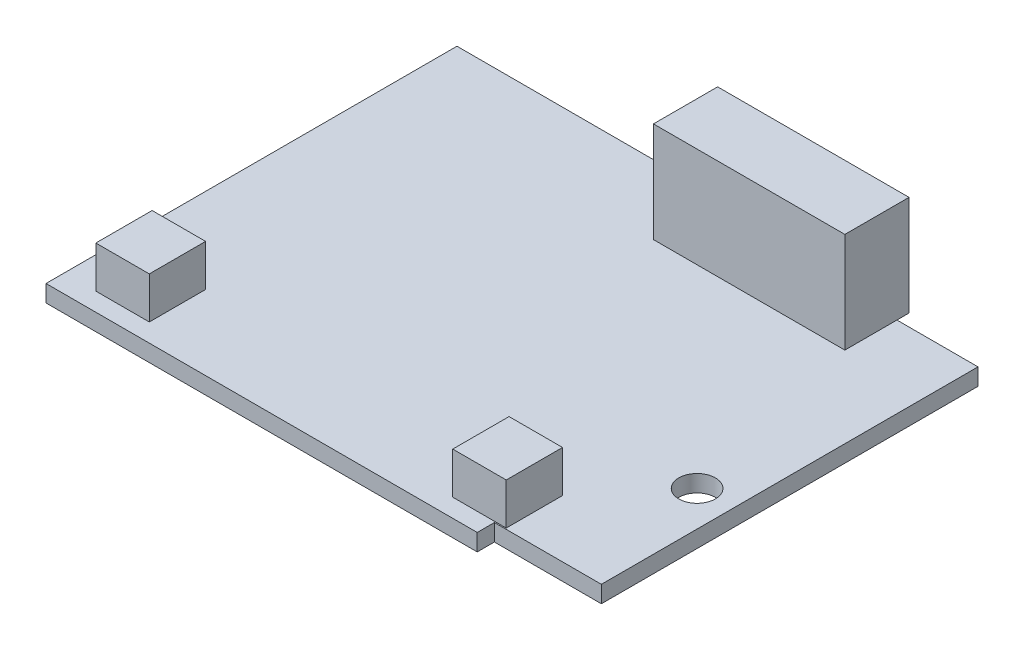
ISO-10303-21;
HEADER;
FILE_DESCRIPTION(('STEP AP214'),'2;1');
FILE_NAME('part.step','',(''),(''),'','','');
FILE_SCHEMA(('AUTOMOTIVE_DESIGN { 1 0 10303 214 1 1 1 1 }'));
ENDSEC;
DATA;
#1=APPLICATION_CONTEXT('core data for automotive mechanical design processes');
#2=APPLICATION_PROTOCOL_DEFINITION('international standard','automotive_design',2000,#1);
#3=PRODUCT_CONTEXT('',#1,'mechanical');
#4=PRODUCT('Part','Part','',(#3));
#5=PRODUCT_RELATED_PRODUCT_CATEGORY('part','',(#4));
#6=PRODUCT_DEFINITION_FORMATION('','',#4);
#7=PRODUCT_DEFINITION_CONTEXT('part definition',#1,'design');
#8=PRODUCT_DEFINITION('design','',#6,#7);
#9=PRODUCT_DEFINITION_SHAPE('','',#8);
#10=(LENGTH_UNIT() NAMED_UNIT(*) SI_UNIT(.MILLI.,.METRE.));
#11=(NAMED_UNIT(*) PLANE_ANGLE_UNIT() SI_UNIT($,.RADIAN.));
#12=(NAMED_UNIT(*) SI_UNIT($,.STERADIAN.) SOLID_ANGLE_UNIT());
#13=UNCERTAINTY_MEASURE_WITH_UNIT(LENGTH_MEASURE(1.E-05),#10,'distance_accuracy_value','');
#14=(GEOMETRIC_REPRESENTATION_CONTEXT(3) GLOBAL_UNCERTAINTY_ASSIGNED_CONTEXT((#13)) GLOBAL_UNIT_ASSIGNED_CONTEXT((#10,
#11,#12)) REPRESENTATION_CONTEXT('',''));
#15=CARTESIAN_POINT('',(0.,0.,0.));
#16=DIRECTION('',(0.,0.,1.));
#17=DIRECTION('',(1.,0.,0.));
#18=AXIS2_PLACEMENT_3D('',#15,#16,#17);
#19=CARTESIAN_POINT('',(-48.5648,0.,18.542));
#20=DIRECTION('',(0.,1.,0.));
#21=DIRECTION('',(0.,0.,1.));
#22=AXIS2_PLACEMENT_3D('',#19,#20,#21);
#23=PLANE('',#22);
#24=DIRECTION('',(0.,0.,-1.));
#25=VECTOR('',#24,1.);
#26=CARTESIAN_POINT('',(-47.1678,0.,6.096));
#27=LINE('',#26,#25);
#28=CARTESIAN_POINT('',(-47.1678,0.,6.096));
#29=VERTEX_POINT('',#28);
#30=CARTESIAN_POINT('',(-47.1678,0.,3.683));
#31=VERTEX_POINT('',#30);
#32=EDGE_CURVE('E256',#29,#31,#27,.T.);
#33=ORIENTED_EDGE('',*,*,#32,.F.);
#34=DIRECTION('',(-1.,0.,0.));
#35=VECTOR('',#34,1.);
#36=CARTESIAN_POINT('',(-47.1678,0.,6.096));
#37=LINE('',#36,#35);
#38=CARTESIAN_POINT('',(-30.4038,0.,6.096));
#39=VERTEX_POINT('',#38);
#40=EDGE_CURVE('E269',#39,#29,#37,.T.);
#41=ORIENTED_EDGE('',*,*,#40,.F.);
#42=DIRECTION('',(0.,0.,1.));
#43=VECTOR('',#42,1.);
#44=CARTESIAN_POINT('',(-30.4038,0.,6.096));
#45=LINE('',#44,#43);
#46=CARTESIAN_POINT('',(-30.4038,0.,3.683));
#47=VERTEX_POINT('',#46);
#48=EDGE_CURVE('E278',#47,#39,#45,.T.);
#49=ORIENTED_EDGE('',*,*,#48,.F.);
#50=DIRECTION('',(1.,0.,0.));
#51=VECTOR('',#50,1.);
#52=CARTESIAN_POINT('',(-30.4038,0.,3.683));
#53=LINE('',#52,#51);
#54=EDGE_CURVE('E259',#31,#47,#53,.T.);
#55=ORIENTED_EDGE('',*,*,#54,.F.);
#56=EDGE_LOOP('',(#33,#41,#49,#55));
#57=FACE_BOUND('',#56,.T.);
#58=DIRECTION('',(0.,0.,1.));
#59=VECTOR('',#58,1.);
#60=CARTESIAN_POINT('',(-48.5648,0.,-18.542));
#61=LINE('',#60,#59);
#62=CARTESIAN_POINT('',(-48.5648,0.,-18.542));
#63=VERTEX_POINT('',#62);
#64=CARTESIAN_POINT('',(-48.5648,0.,18.542));
#65=VERTEX_POINT('',#64);
#66=EDGE_CURVE('E394',#63,#65,#61,.T.);
#67=ORIENTED_EDGE('',*,*,#66,.F.);
#68=DIRECTION('',(-1.,0.,0.));
#69=VECTOR('',#68,1.);
#70=CARTESIAN_POINT('',(-48.5648,0.,-18.542));
#71=LINE('',#70,#69);
#72=CARTESIAN_POINT('',(-9.652,0.,-18.542));
#73=VERTEX_POINT('',#72);
#74=EDGE_CURVE('E401',#73,#63,#71,.T.);
#75=ORIENTED_EDGE('',*,*,#74,.F.);
#76=DIRECTION('',(0.,0.,-1.));
#77=VECTOR('',#76,1.);
#78=CARTESIAN_POINT('',(-9.652,0.,-18.542));
#79=LINE('',#78,#77);
#80=CARTESIAN_POINT('',(-9.652,0.,-16.9926));
#81=VERTEX_POINT('',#80);
#82=EDGE_CURVE('E432',#81,#73,#79,.T.);
#83=ORIENTED_EDGE('',*,*,#82,.F.);
#84=DIRECTION('',(-1.,0.,0.));
#85=VECTOR('',#84,1.);
#86=CARTESIAN_POINT('',(-9.652,0.,-16.9926));
#87=LINE('',#86,#85);
#88=CARTESIAN_POINT('',(0.,0.,-16.9926));
#89=VERTEX_POINT('',#88);
#90=EDGE_CURVE('E430',#89,#81,#87,.T.);
#91=ORIENTED_EDGE('',*,*,#90,.F.);
#92=DIRECTION('',(0.,0.,-1.));
#93=VECTOR('',#92,1.);
#94=CARTESIAN_POINT('',(0.,0.,-16.9926));
#95=LINE('',#94,#93);
#96=CARTESIAN_POINT('',(0.,0.,16.9926));
#97=VERTEX_POINT('',#96);
#98=EDGE_CURVE('E428',#97,#89,#95,.T.);
#99=ORIENTED_EDGE('',*,*,#98,.F.);
#100=DIRECTION('',(1.,0.,0.));
#101=VECTOR('',#100,1.);
#102=CARTESIAN_POINT('',(-9.652,0.,16.9926));
#103=LINE('',#102,#101);
#104=CARTESIAN_POINT('',(-9.652,0.,16.9926));
#105=VERTEX_POINT('',#104);
#106=EDGE_CURVE('E426',#105,#97,#103,.T.);
#107=ORIENTED_EDGE('',*,*,#106,.F.);
#108=DIRECTION('',(0.,0.,-1.));
#109=VECTOR('',#108,1.);
#110=CARTESIAN_POINT('',(-9.652,0.,18.542));
#111=LINE('',#110,#109);
#112=CARTESIAN_POINT('',(-9.652,0.,18.542));
#113=VERTEX_POINT('',#112);
#114=EDGE_CURVE('E424',#113,#105,#111,.T.);
#115=ORIENTED_EDGE('',*,*,#114,.F.);
#116=DIRECTION('',(1.,0.,0.));
#117=VECTOR('',#116,1.);
#118=CARTESIAN_POINT('',(-48.5648,0.,18.542));
#119=LINE('',#118,#117);
#120=EDGE_CURVE('E422',#65,#113,#119,.T.);
#121=ORIENTED_EDGE('',*,*,#120,.F.);
#122=EDGE_LOOP('',(#67,#75,#83,#91,#99,#107,#115,#121));
#123=FACE_BOUND('',#122,.T.);
#124=CARTESIAN_POINT('',(-3.175,0.,5.1816));
#125=DIRECTION('',(0.,1.,0.));
#126=DIRECTION('',(0.,0.,1.));
#127=AXIS2_PLACEMENT_3D('',#124,#125,#126);
#128=CIRCLE('',#127,1.651);
#129=CARTESIAN_POINT('',(-3.175,0.,6.8326));
#130=VERTEX_POINT('',#129);
#131=EDGE_CURVE('E390',#130,#130,#128,.T.);
#132=ORIENTED_EDGE('',*,*,#131,.T.);
#133=EDGE_LOOP('',(#132));
#134=FACE_BOUND('',#133,.T.);
#135=DIRECTION('',(0.,0.,1.));
#136=VECTOR('',#135,1.);
#137=CARTESIAN_POINT('',(-30.4038,0.,-3.8862));
#138=LINE('',#137,#136);
#139=CARTESIAN_POINT('',(-30.4038,0.,-6.2992));
#140=VERTEX_POINT('',#139);
#141=CARTESIAN_POINT('',(-30.4038,0.,-3.8862));
#142=VERTEX_POINT('',#141);
#143=EDGE_CURVE('E255',#140,#142,#138,.T.);
#144=ORIENTED_EDGE('',*,*,#143,.F.);
#145=DIRECTION('',(1.,0.,0.));
#146=VECTOR('',#145,1.);
#147=CARTESIAN_POINT('',(-47.1678,0.,-6.2992));
#148=LINE('',#147,#146);
#149=CARTESIAN_POINT('',(-47.1678,0.,-6.2992));
#150=VERTEX_POINT('',#149);
#151=EDGE_CURVE('E252',#150,#140,#148,.T.);
#152=ORIENTED_EDGE('',*,*,#151,.F.);
#153=DIRECTION('',(0.,0.,-1.));
#154=VECTOR('',#153,1.);
#155=CARTESIAN_POINT('',(-47.1678,0.,-3.8862));
#156=LINE('',#155,#154);
#157=CARTESIAN_POINT('',(-47.1678,0.,-3.8862));
#158=VERTEX_POINT('',#157);
#159=EDGE_CURVE('E64',#158,#150,#156,.T.);
#160=ORIENTED_EDGE('',*,*,#159,.F.);
#161=DIRECTION('',(-1.,0.,0.));
#162=VECTOR('',#161,1.);
#163=CARTESIAN_POINT('',(-30.4038,0.,-3.8862));
#164=LINE('',#163,#162);
#165=EDGE_CURVE('E59',#142,#158,#164,.T.);
#166=ORIENTED_EDGE('',*,*,#165,.F.);
#167=EDGE_LOOP('',(#144,#152,#160,#166));
#168=FACE_BOUND('',#167,.T.);
#169=ADVANCED_FACE('F42',(#57,#123,#134,#168),#23,.F.);
#170=CARTESIAN_POINT('',(-48.5648,1.52399999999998,18.542));
#171=DIRECTION('',(0.,1.,0.));
#172=DIRECTION('',(0.,0.,1.));
#173=AXIS2_PLACEMENT_3D('',#170,#171,#172);
#174=PLANE('',#173);
#175=DIRECTION('',(1.,0.,0.));
#176=VECTOR('',#175,1.);
#177=CARTESIAN_POINT('',(-45.72,1.524,16.891));
#178=LINE('',#177,#176);
#179=CARTESIAN_POINT('',(-45.72,1.524,16.891));
#180=VERTEX_POINT('',#179);
#181=CARTESIAN_POINT('',(-40.894,1.524,16.891));
#182=VERTEX_POINT('',#181);
#183=EDGE_CURVE('E335',#180,#182,#178,.T.);
#184=ORIENTED_EDGE('',*,*,#183,.F.);
#185=DIRECTION('',(0.,0.,1.));
#186=VECTOR('',#185,1.);
#187=CARTESIAN_POINT('',(-45.72,1.524,11.811));
#188=LINE('',#187,#186);
#189=CARTESIAN_POINT('',(-45.72,1.524,11.811));
#190=VERTEX_POINT('',#189);
#191=EDGE_CURVE('E339',#190,#180,#188,.T.);
#192=ORIENTED_EDGE('',*,*,#191,.F.);
#193=DIRECTION('',(-1.,0.,0.));
#194=VECTOR('',#193,1.);
#195=CARTESIAN_POINT('',(-45.72,1.524,11.811));
#196=LINE('',#195,#194);
#197=CARTESIAN_POINT('',(-40.894,1.524,11.811));
#198=VERTEX_POINT('',#197);
#199=EDGE_CURVE('E327',#198,#190,#196,.T.);
#200=ORIENTED_EDGE('',*,*,#199,.F.);
#201=DIRECTION('',(0.,0.,-1.));
#202=VECTOR('',#201,1.);
#203=CARTESIAN_POINT('',(-40.894,1.524,11.811));
#204=LINE('',#203,#202);
#205=EDGE_CURVE('E332',#182,#198,#204,.T.);
#206=ORIENTED_EDGE('',*,*,#205,.F.);
#207=EDGE_LOOP('',(#184,#192,#200,#206));
#208=FACE_BOUND('',#207,.T.);
#209=DIRECTION('',(-1.,0.,0.));
#210=VECTOR('',#209,1.);
#211=CARTESIAN_POINT('',(-24.5872,1.524,-18.0848));
#212=LINE('',#211,#210);
#213=CARTESIAN_POINT('',(-9.65199999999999,1.524,-18.0848));
#214=VERTEX_POINT('',#213);
#215=CARTESIAN_POINT('',(-24.5872,1.524,-18.0848));
#216=VERTEX_POINT('',#215);
#217=EDGE_CURVE('E12',#214,#216,#212,.T.);
#218=ORIENTED_EDGE('',*,*,#217,.F.);
#219=DIRECTION('',(0.,0.,-1.));
#220=VECTOR('',#219,1.);
#221=CARTESIAN_POINT('',(-9.65199999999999,1.524,-18.542));
#222=LINE('',#221,#220);
#223=CARTESIAN_POINT('',(-9.65199999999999,1.524,-18.542));
#224=VERTEX_POINT('',#223);
#225=EDGE_CURVE('E413',#214,#224,#222,.T.);
#226=ORIENTED_EDGE('',*,*,#225,.T.);
#227=DIRECTION('',(-1.,0.,0.));
#228=VECTOR('',#227,1.);
#229=CARTESIAN_POINT('',(-48.5648,1.52399999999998,-18.542));
#230=LINE('',#229,#228);
#231=CARTESIAN_POINT('',(-48.5648,1.52399999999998,-18.542));
#232=VERTEX_POINT('',#231);
#233=EDGE_CURVE('E417',#224,#232,#230,.T.);
#234=ORIENTED_EDGE('',*,*,#233,.T.);
#235=DIRECTION('',(0.,0.,1.));
#236=VECTOR('',#235,1.);
#237=CARTESIAN_POINT('',(-48.5648,1.52399999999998,-18.542));
#238=LINE('',#237,#236);
#239=CARTESIAN_POINT('',(-48.5648,1.52399999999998,18.542));
#240=VERTEX_POINT('',#239);
#241=EDGE_CURVE('E397',#232,#240,#238,.T.);
#242=ORIENTED_EDGE('',*,*,#241,.T.);
#243=DIRECTION('',(1.,0.,0.));
#244=VECTOR('',#243,1.);
#245=CARTESIAN_POINT('',(-48.5648,1.52399999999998,18.542));
#246=LINE('',#245,#244);
#247=CARTESIAN_POINT('',(-9.65199999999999,1.524,18.542));
#248=VERTEX_POINT('',#247);
#249=EDGE_CURVE('E400',#240,#248,#246,.T.);
#250=ORIENTED_EDGE('',*,*,#249,.T.);
#251=DIRECTION('',(0.,0.,-1.));
#252=VECTOR('',#251,1.);
#253=CARTESIAN_POINT('',(-9.65199999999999,1.524,18.542));
#254=LINE('',#253,#252);
#255=CARTESIAN_POINT('',(-9.652,1.524,16.9926));
#256=VERTEX_POINT('',#255);
#257=EDGE_CURVE('E403',#248,#256,#254,.T.);
#258=ORIENTED_EDGE('',*,*,#257,.T.);
#259=DIRECTION('',(1.,0.,0.));
#260=VECTOR('',#259,1.);
#261=CARTESIAN_POINT('',(-9.652,1.524,16.9926));
#262=LINE('',#261,#260);
#263=CARTESIAN_POINT('',(0.,1.52400000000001,16.9926));
#264=VERTEX_POINT('',#263);
#265=EDGE_CURVE('E405',#256,#264,#262,.T.);
#266=ORIENTED_EDGE('',*,*,#265,.T.);
#267=DIRECTION('',(0.,0.,-1.));
#268=VECTOR('',#267,1.);
#269=CARTESIAN_POINT('',(0.,1.52400000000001,-16.9926));
#270=LINE('',#269,#268);
#271=CARTESIAN_POINT('',(0.,1.52400000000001,-16.9926));
#272=VERTEX_POINT('',#271);
#273=EDGE_CURVE('E407',#264,#272,#270,.T.);
#274=ORIENTED_EDGE('',*,*,#273,.T.);
#275=DIRECTION('',(-1.,0.,0.));
#276=VECTOR('',#275,1.);
#277=CARTESIAN_POINT('',(-9.652,1.524,-16.9926));
#278=LINE('',#277,#276);
#279=CARTESIAN_POINT('',(-7.31520000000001,1.524,-16.9926));
#280=VERTEX_POINT('',#279);
#281=EDGE_CURVE('E410',#272,#280,#278,.T.);
#282=ORIENTED_EDGE('',*,*,#281,.T.);
#283=DIRECTION('',(0.,0.,-1.));
#284=VECTOR('',#283,1.);
#285=CARTESIAN_POINT('',(-7.31520000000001,1.524,-18.0848));
#286=LINE('',#285,#284);
#287=CARTESIAN_POINT('',(-7.3152,1.524,-12.2936));
#288=VERTEX_POINT('',#287);
#289=EDGE_CURVE('E375',#288,#280,#286,.T.);
#290=ORIENTED_EDGE('',*,*,#289,.F.);
#291=DIRECTION('',(1.,0.,0.));
#292=VECTOR('',#291,1.);
#293=CARTESIAN_POINT('',(-24.5872,1.524,-12.2936));
#294=LINE('',#293,#292);
#295=CARTESIAN_POINT('',(-24.5872,1.524,-12.2936));
#296=VERTEX_POINT('',#295);
#297=EDGE_CURVE('E371',#296,#288,#294,.T.);
#298=ORIENTED_EDGE('',*,*,#297,.F.);
#299=DIRECTION('',(0.,0.,1.));
#300=VECTOR('',#299,1.);
#301=CARTESIAN_POINT('',(-24.5872,1.524,-18.0848));
#302=LINE('',#301,#300);
#303=EDGE_CURVE('E345',#216,#296,#302,.T.);
#304=ORIENTED_EDGE('',*,*,#303,.F.);
#305=EDGE_LOOP('',(#218,#226,#234,#242,#250,#258,#266,#274,#282,#290,#298,#304));
#306=FACE_BOUND('',#305,.T.);
#307=CARTESIAN_POINT('',(-3.17499999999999,1.524,5.1816));
#308=DIRECTION('',(0.,1.,0.));
#309=DIRECTION('',(0.,0.,1.));
#310=AXIS2_PLACEMENT_3D('',#307,#308,#309);
#311=CIRCLE('',#310,1.651);
#312=CARTESIAN_POINT('',(-3.17499999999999,1.524,6.8326));
#313=VERTEX_POINT('',#312);
#314=EDGE_CURVE('E391',#313,#313,#311,.T.);
#315=ORIENTED_EDGE('',*,*,#314,.F.);
#316=EDGE_LOOP('',(#315));
#317=FACE_BOUND('',#316,.T.);
#318=DIRECTION('',(1.,0.,0.));
#319=VECTOR('',#318,1.);
#320=CARTESIAN_POINT('',(-13.5128,1.524,16.891));
#321=LINE('',#320,#319);
#322=CARTESIAN_POINT('',(-13.5128,1.524,16.891));
#323=VERTEX_POINT('',#322);
#324=CARTESIAN_POINT('',(-8.6868,1.524,16.891));
#325=VERTEX_POINT('',#324);
#326=EDGE_CURVE('E303',#323,#325,#321,.T.);
#327=ORIENTED_EDGE('',*,*,#326,.F.);
#328=DIRECTION('',(0.,0.,1.));
#329=VECTOR('',#328,1.);
#330=CARTESIAN_POINT('',(-13.5128,1.524,11.811));
#331=LINE('',#330,#329);
#332=CARTESIAN_POINT('',(-13.5128,1.524,11.811));
#333=VERTEX_POINT('',#332);
#334=EDGE_CURVE('E307',#333,#323,#331,.T.);
#335=ORIENTED_EDGE('',*,*,#334,.F.);
#336=DIRECTION('',(-1.,0.,0.));
#337=VECTOR('',#336,1.);
#338=CARTESIAN_POINT('',(-13.5128,1.524,11.811));
#339=LINE('',#338,#337);
#340=CARTESIAN_POINT('',(-8.6868,1.524,11.811));
#341=VERTEX_POINT('',#340);
#342=EDGE_CURVE('E295',#341,#333,#339,.T.);
#343=ORIENTED_EDGE('',*,*,#342,.F.);
#344=DIRECTION('',(0.,0.,-1.));
#345=VECTOR('',#344,1.);
#346=CARTESIAN_POINT('',(-8.6868,1.524,11.811));
#347=LINE('',#346,#345);
#348=EDGE_CURVE('E300',#325,#341,#347,.T.);
#349=ORIENTED_EDGE('',*,*,#348,.F.);
#350=EDGE_LOOP('',(#327,#335,#343,#349));
#351=FACE_BOUND('',#350,.T.);
#352=ADVANCED_FACE('F479',(#208,#306,#317,#351),#174,.T.);
#353=CARTESIAN_POINT('',(-48.5648,1.52399999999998,-18.542));
#354=DIRECTION('',(1.,0.,0.));
#355=DIRECTION('',(0.,0.,-1.));
#356=AXIS2_PLACEMENT_3D('',#353,#354,#355);
#357=PLANE('',#356);
#358=ORIENTED_EDGE('',*,*,#66,.T.);
#359=DIRECTION('',(0.,-1.,0.));
#360=VECTOR('',#359,1.);
#361=CARTESIAN_POINT('',(-48.5648,1.52399999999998,18.542));
#362=LINE('',#361,#360);
#363=EDGE_CURVE('E46',#240,#65,#362,.T.);
#364=ORIENTED_EDGE('',*,*,#363,.F.);
#365=ORIENTED_EDGE('',*,*,#241,.F.);
#366=DIRECTION('',(0.,-1.,0.));
#367=VECTOR('',#366,1.);
#368=CARTESIAN_POINT('',(-48.5648,1.52399999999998,-18.542));
#369=LINE('',#368,#367);
#370=EDGE_CURVE('E419',#232,#63,#369,.T.);
#371=ORIENTED_EDGE('',*,*,#370,.T.);
#372=EDGE_LOOP('',(#358,#364,#365,#371));
#373=FACE_BOUND('',#372,.T.);
#374=ADVANCED_FACE('F44',(#373),#357,.F.);
#375=CARTESIAN_POINT('',(-48.5648,1.52399999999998,18.542));
#376=DIRECTION('',(0.,0.,-1.));
#377=DIRECTION('',(-1.,0.,0.));
#378=AXIS2_PLACEMENT_3D('',#375,#376,#377);
#379=PLANE('',#378);
#380=ORIENTED_EDGE('',*,*,#120,.T.);
#381=DIRECTION('',(0.,-1.,0.));
#382=VECTOR('',#381,1.);
#383=CARTESIAN_POINT('',(-9.65199999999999,1.524,18.542));
#384=LINE('',#383,#382);
#385=EDGE_CURVE('E451',#248,#113,#384,.T.);
#386=ORIENTED_EDGE('',*,*,#385,.F.);
#387=ORIENTED_EDGE('',*,*,#249,.F.);
#388=ORIENTED_EDGE('',*,*,#363,.T.);
#389=EDGE_LOOP('',(#380,#386,#387,#388));
#390=FACE_BOUND('',#389,.T.);
#391=ADVANCED_FACE('F460',(#390),#379,.F.);
#392=CARTESIAN_POINT('',(-9.65199999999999,1.524,18.542));
#393=DIRECTION('',(-1.,0.,0.));
#394=DIRECTION('',(0.,0.,1.));
#395=AXIS2_PLACEMENT_3D('',#392,#393,#394);
#396=PLANE('',#395);
#397=ORIENTED_EDGE('',*,*,#114,.T.);
#398=DIRECTION('',(0.,-1.,0.));
#399=VECTOR('',#398,1.);
#400=CARTESIAN_POINT('',(-9.652,1.524,16.9926));
#401=LINE('',#400,#399);
#402=EDGE_CURVE('E449',#256,#105,#401,.T.);
#403=ORIENTED_EDGE('',*,*,#402,.F.);
#404=ORIENTED_EDGE('',*,*,#257,.F.);
#405=ORIENTED_EDGE('',*,*,#385,.T.);
#406=EDGE_LOOP('',(#397,#403,#404,#405));
#407=FACE_BOUND('',#406,.T.);
#408=ADVANCED_FACE('F472',(#407),#396,.F.);
#409=CARTESIAN_POINT('',(-9.652,1.524,16.9926));
#410=DIRECTION('',(0.,0.,-1.));
#411=DIRECTION('',(-1.,0.,0.));
#412=AXIS2_PLACEMENT_3D('',#409,#410,#411);
#413=PLANE('',#412);
#414=ORIENTED_EDGE('',*,*,#106,.T.);
#415=DIRECTION('',(0.,-1.,0.));
#416=VECTOR('',#415,1.);
#417=CARTESIAN_POINT('',(0.,1.52400000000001,16.9926));
#418=LINE('',#417,#416);
#419=EDGE_CURVE('E446',#264,#97,#418,.T.);
#420=ORIENTED_EDGE('',*,*,#419,.F.);
#421=ORIENTED_EDGE('',*,*,#265,.F.);
#422=ORIENTED_EDGE('',*,*,#402,.T.);
#423=EDGE_LOOP('',(#414,#420,#421,#422));
#424=FACE_BOUND('',#423,.T.);
#425=ADVANCED_FACE('F475',(#424),#413,.F.);
#426=CARTESIAN_POINT('',(0.,1.52400000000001,-16.9926));
#427=DIRECTION('',(-1.,0.,0.));
#428=DIRECTION('',(0.,0.,1.));
#429=AXIS2_PLACEMENT_3D('',#426,#427,#428);
#430=PLANE('',#429);
#431=ORIENTED_EDGE('',*,*,#98,.T.);
#432=DIRECTION('',(0.,-1.,0.));
#433=VECTOR('',#432,1.);
#434=CARTESIAN_POINT('',(0.,1.52400000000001,-16.9926));
#435=LINE('',#434,#433);
#436=EDGE_CURVE('E443',#272,#89,#435,.T.);
#437=ORIENTED_EDGE('',*,*,#436,.F.);
#438=ORIENTED_EDGE('',*,*,#273,.F.);
#439=ORIENTED_EDGE('',*,*,#419,.T.);
#440=EDGE_LOOP('',(#431,#437,#438,#439));
#441=FACE_BOUND('',#440,.T.);
#442=ADVANCED_FACE('F495',(#441),#430,.F.);
#443=CARTESIAN_POINT('',(-9.652,1.524,-16.9926));
#444=DIRECTION('',(0.,0.,1.));
#445=DIRECTION('',(1.,0.,0.));
#446=AXIS2_PLACEMENT_3D('',#443,#444,#445);
#447=PLANE('',#446);
#448=ORIENTED_EDGE('',*,*,#90,.T.);
#449=DIRECTION('',(0.,-1.,0.));
#450=VECTOR('',#449,1.);
#451=CARTESIAN_POINT('',(-9.652,1.524,-16.9926));
#452=LINE('',#451,#450);
#453=CARTESIAN_POINT('',(-9.652,1.524,-16.9926));
#454=VERTEX_POINT('',#453);
#455=EDGE_CURVE('E440',#454,#81,#452,.T.);
#456=ORIENTED_EDGE('',*,*,#455,.F.);
#457=EDGE_CURVE('E409',#280,#454,#278,.T.);
#458=ORIENTED_EDGE('',*,*,#457,.F.);
#459=ORIENTED_EDGE('',*,*,#281,.F.);
#460=ORIENTED_EDGE('',*,*,#436,.T.);
#461=EDGE_LOOP('',(#448,#456,#458,#459,#460));
#462=FACE_BOUND('',#461,.T.);
#463=ADVANCED_FACE('F492',(#462),#447,.F.);
#464=CARTESIAN_POINT('',(-9.65199999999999,1.524,-18.542));
#465=DIRECTION('',(-1.,0.,0.));
#466=DIRECTION('',(0.,0.,1.));
#467=AXIS2_PLACEMENT_3D('',#464,#465,#466);
#468=PLANE('',#467);
#469=ORIENTED_EDGE('',*,*,#82,.T.);
#470=DIRECTION('',(0.,-1.,0.));
#471=VECTOR('',#470,1.);
#472=CARTESIAN_POINT('',(-9.65199999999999,1.524,-18.542));
#473=LINE('',#472,#471);
#474=EDGE_CURVE('E437',#224,#73,#473,.T.);
#475=ORIENTED_EDGE('',*,*,#474,.F.);
#476=ORIENTED_EDGE('',*,*,#225,.F.);
#477=EDGE_CURVE('E414',#454,#214,#222,.T.);
#478=ORIENTED_EDGE('',*,*,#477,.F.);
#479=ORIENTED_EDGE('',*,*,#455,.T.);
#480=EDGE_LOOP('',(#469,#475,#476,#478,#479));
#481=FACE_BOUND('',#480,.T.);
#482=ADVANCED_FACE('F488',(#481),#468,.F.);
#483=CARTESIAN_POINT('',(-48.5648,1.52399999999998,-18.542));
#484=DIRECTION('',(0.,0.,1.));
#485=DIRECTION('',(1.,0.,0.));
#486=AXIS2_PLACEMENT_3D('',#483,#484,#485);
#487=PLANE('',#486);
#488=ORIENTED_EDGE('',*,*,#74,.T.);
#489=ORIENTED_EDGE('',*,*,#370,.F.);
#490=ORIENTED_EDGE('',*,*,#233,.F.);
#491=ORIENTED_EDGE('',*,*,#474,.T.);
#492=EDGE_LOOP('',(#488,#489,#490,#491));
#493=FACE_BOUND('',#492,.T.);
#494=ADVANCED_FACE('F486',(#493),#487,.F.);
#495=CARTESIAN_POINT('',(-3.17499999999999,1.524,5.1816));
#496=DIRECTION('',(0.,-1.,0.));
#497=DIRECTION('',(0.,0.,-1.));
#498=AXIS2_PLACEMENT_3D('',#495,#496,#497);
#499=CYLINDRICAL_SURFACE('',#498,1.651);
#500=ORIENTED_EDGE('',*,*,#314,.T.);
#501=EDGE_LOOP('',(#500));
#502=FACE_BOUND('',#501,.T.);
#503=ORIENTED_EDGE('',*,*,#131,.F.);
#504=EDGE_LOOP('',(#503));
#505=FACE_BOUND('',#504,.T.);
#506=ADVANCED_FACE('F516',(#502,#505),#499,.F.);
#507=CARTESIAN_POINT('',(-24.5872,1.524,-12.2936));
#508=DIRECTION('',(0.,1.,0.));
#509=DIRECTION('',(0.,0.,1.));
#510=AXIS2_PLACEMENT_3D('',#507,#508,#509);
#511=PLANE('',#510);
#512=CARTESIAN_POINT('',(-7.31520000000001,1.524,-18.0848));
#513=VERTEX_POINT('',#512);
#514=EDGE_CURVE('E374',#280,#513,#286,.T.);
#515=ORIENTED_EDGE('',*,*,#514,.F.);
#516=ORIENTED_EDGE('',*,*,#457,.T.);
#517=ORIENTED_EDGE('',*,*,#477,.T.);
#518=EDGE_CURVE('E52',#513,#214,#212,.T.);
#519=ORIENTED_EDGE('',*,*,#518,.F.);
#520=EDGE_LOOP('',(#515,#516,#517,#519));
#521=FACE_BOUND('',#520,.T.);
#522=ADVANCED_FACE('F532',(#521),#511,.F.);
#523=CARTESIAN_POINT('',(-24.5872,10.5664,-18.0848));
#524=DIRECTION('',(1.,0.,0.));
#525=DIRECTION('',(0.,0.,-1.));
#526=AXIS2_PLACEMENT_3D('',#523,#524,#525);
#527=PLANE('',#526);
#528=ORIENTED_EDGE('',*,*,#303,.T.);
#529=DIRECTION('',(0.,-1.,0.));
#530=VECTOR('',#529,1.);
#531=CARTESIAN_POINT('',(-24.5872,10.5664,-12.2936));
#532=LINE('',#531,#530);
#533=CARTESIAN_POINT('',(-24.5872,10.5664,-12.2936));
#534=VERTEX_POINT('',#533);
#535=EDGE_CURVE('E387',#534,#296,#532,.T.);
#536=ORIENTED_EDGE('',*,*,#535,.F.);
#537=DIRECTION('',(0.,0.,1.));
#538=VECTOR('',#537,1.);
#539=CARTESIAN_POINT('',(-24.5872,10.5664,-18.0848));
#540=LINE('',#539,#538);
#541=CARTESIAN_POINT('',(-24.5872,10.5664,-18.0848));
#542=VERTEX_POINT('',#541);
#543=EDGE_CURVE('E359',#542,#534,#540,.T.);
#544=ORIENTED_EDGE('',*,*,#543,.F.);
#545=DIRECTION('',(0.,-1.,0.));
#546=VECTOR('',#545,1.);
#547=CARTESIAN_POINT('',(-24.5872,10.5664,-18.0848));
#548=LINE('',#547,#546);
#549=EDGE_CURVE('E368',#542,#216,#548,.T.);
#550=ORIENTED_EDGE('',*,*,#549,.T.);
#551=EDGE_LOOP('',(#528,#536,#544,#550));
#552=FACE_BOUND('',#551,.T.);
#553=ADVANCED_FACE('F539',(#552),#527,.F.);
#554=CARTESIAN_POINT('',(-24.5872,10.5664,-12.2936));
#555=DIRECTION('',(0.,0.,-1.));
#556=DIRECTION('',(-1.,0.,0.));
#557=AXIS2_PLACEMENT_3D('',#554,#555,#556);
#558=PLANE('',#557);
#559=ORIENTED_EDGE('',*,*,#297,.T.);
#560=DIRECTION('',(0.,-1.,0.));
#561=VECTOR('',#560,1.);
#562=CARTESIAN_POINT('',(-7.31519999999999,10.5664,-12.2936));
#563=LINE('',#562,#561);
#564=CARTESIAN_POINT('',(-7.31519999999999,10.5664,-12.2936));
#565=VERTEX_POINT('',#564);
#566=EDGE_CURVE('E384',#565,#288,#563,.T.);
#567=ORIENTED_EDGE('',*,*,#566,.F.);
#568=DIRECTION('',(1.,0.,0.));
#569=VECTOR('',#568,1.);
#570=CARTESIAN_POINT('',(-24.5872,10.5664,-12.2936));
#571=LINE('',#570,#569);
#572=EDGE_CURVE('E362',#534,#565,#571,.T.);
#573=ORIENTED_EDGE('',*,*,#572,.F.);
#574=ORIENTED_EDGE('',*,*,#535,.T.);
#575=EDGE_LOOP('',(#559,#567,#573,#574));
#576=FACE_BOUND('',#575,.T.);
#577=ADVANCED_FACE('F547',(#576),#558,.F.);
#578=CARTESIAN_POINT('',(-7.31519999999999,10.5664,-18.0848));
#579=DIRECTION('',(-1.,0.,0.));
#580=DIRECTION('',(0.,0.,1.));
#581=AXIS2_PLACEMENT_3D('',#578,#579,#580);
#582=PLANE('',#581);
#583=ORIENTED_EDGE('',*,*,#289,.T.);
#584=ORIENTED_EDGE('',*,*,#514,.T.);
#585=DIRECTION('',(0.,-1.,0.));
#586=VECTOR('',#585,1.);
#587=CARTESIAN_POINT('',(-7.31519999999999,10.5664,-18.0848));
#588=LINE('',#587,#586);
#589=CARTESIAN_POINT('',(-7.31519999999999,10.5664,-18.0848));
#590=VERTEX_POINT('',#589);
#591=EDGE_CURVE('E381',#590,#513,#588,.T.);
#592=ORIENTED_EDGE('',*,*,#591,.F.);
#593=DIRECTION('',(0.,0.,-1.));
#594=VECTOR('',#593,1.);
#595=CARTESIAN_POINT('',(-7.31519999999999,10.5664,-18.0848));
#596=LINE('',#595,#594);
#597=EDGE_CURVE('E364',#565,#590,#596,.T.);
#598=ORIENTED_EDGE('',*,*,#597,.F.);
#599=ORIENTED_EDGE('',*,*,#566,.T.);
#600=EDGE_LOOP('',(#583,#584,#592,#598,#599));
#601=FACE_BOUND('',#600,.T.);
#602=ADVANCED_FACE('F555',(#601),#582,.F.);
#603=CARTESIAN_POINT('',(-24.5872,10.5664,-18.0848));
#604=DIRECTION('',(0.,0.,1.));
#605=DIRECTION('',(1.,0.,0.));
#606=AXIS2_PLACEMENT_3D('',#603,#604,#605);
#607=PLANE('',#606);
#608=ORIENTED_EDGE('',*,*,#518,.T.);
#609=ORIENTED_EDGE('',*,*,#217,.T.);
#610=ORIENTED_EDGE('',*,*,#549,.F.);
#611=DIRECTION('',(-1.,0.,0.));
#612=VECTOR('',#611,1.);
#613=CARTESIAN_POINT('',(-24.5872,10.5664,-18.0848));
#614=LINE('',#613,#612);
#615=EDGE_CURVE('E366',#590,#542,#614,.T.);
#616=ORIENTED_EDGE('',*,*,#615,.F.);
#617=ORIENTED_EDGE('',*,*,#591,.T.);
#618=EDGE_LOOP('',(#608,#609,#610,#616,#617));
#619=FACE_BOUND('',#618,.T.);
#620=ADVANCED_FACE('F563',(#619),#607,.F.);
#621=CARTESIAN_POINT('',(-24.5872,10.5664,-12.2936));
#622=DIRECTION('',(0.,1.,0.));
#623=DIRECTION('',(0.,0.,1.));
#624=AXIS2_PLACEMENT_3D('',#621,#622,#623);
#625=PLANE('',#624);
#626=ORIENTED_EDGE('',*,*,#543,.T.);
#627=ORIENTED_EDGE('',*,*,#572,.T.);
#628=ORIENTED_EDGE('',*,*,#597,.T.);
#629=ORIENTED_EDGE('',*,*,#615,.T.);
#630=EDGE_LOOP('',(#626,#627,#628,#629));
#631=FACE_BOUND('',#630,.T.);
#632=ADVANCED_FACE('F571',(#631),#625,.T.);
#633=CARTESIAN_POINT('',(-45.72,17.5733020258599,11.811));
#634=DIRECTION('',(1.,0.,0.));
#635=DIRECTION('',(0.,0.,-1.));
#636=AXIS2_PLACEMENT_3D('',#633,#634,#635);
#637=PLANE('',#636);
#638=DIRECTION('',(0.,0.,1.));
#639=VECTOR('',#638,1.);
#640=CARTESIAN_POINT('',(-45.72,5.28319999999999,11.811));
#641=LINE('',#640,#639);
#642=CARTESIAN_POINT('',(-45.72,5.28319999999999,11.811));
#643=VERTEX_POINT('',#642);
#644=CARTESIAN_POINT('',(-45.72,5.28320000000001,16.891));
#645=VERTEX_POINT('',#644);
#646=EDGE_CURVE('E349',#643,#645,#641,.T.);
#647=ORIENTED_EDGE('',*,*,#646,.F.);
#648=DIRECTION('',(0.,-1.,0.));
#649=VECTOR('',#648,1.);
#650=CARTESIAN_POINT('',(-45.72,17.5733020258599,11.811));
#651=LINE('',#650,#649);
#652=EDGE_CURVE('E313',#643,#190,#651,.T.);
#653=ORIENTED_EDGE('',*,*,#652,.T.);
#654=ORIENTED_EDGE('',*,*,#191,.T.);
#655=DIRECTION('',(0.,-1.,0.));
#656=VECTOR('',#655,1.);
#657=CARTESIAN_POINT('',(-45.72,17.5733020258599,16.891));
#658=LINE('',#657,#656);
#659=EDGE_CURVE('E338',#645,#180,#658,.T.);
#660=ORIENTED_EDGE('',*,*,#659,.F.);
#661=EDGE_LOOP('',(#647,#653,#654,#660));
#662=FACE_BOUND('',#661,.T.);
#663=ADVANCED_FACE('F579',(#662),#637,.F.);
#664=CARTESIAN_POINT('',(-45.72,17.5733020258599,16.891));
#665=DIRECTION('',(0.,0.,-1.));
#666=DIRECTION('',(-1.,0.,0.));
#667=AXIS2_PLACEMENT_3D('',#664,#665,#666);
#668=PLANE('',#667);
#669=DIRECTION('',(1.,0.,0.));
#670=VECTOR('',#669,1.);
#671=CARTESIAN_POINT('',(-45.72,5.28319999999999,16.891));
#672=LINE('',#671,#670);
#673=CARTESIAN_POINT('',(-40.894,5.28320000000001,16.891));
#674=VERTEX_POINT('',#673);
#675=EDGE_CURVE('E346',#645,#674,#672,.T.);
#676=ORIENTED_EDGE('',*,*,#675,.F.);
#677=ORIENTED_EDGE('',*,*,#659,.T.);
#678=ORIENTED_EDGE('',*,*,#183,.T.);
#679=DIRECTION('',(0.,-1.,0.));
#680=VECTOR('',#679,1.);
#681=CARTESIAN_POINT('',(-40.894,17.5733020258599,16.891));
#682=LINE('',#681,#680);
#683=EDGE_CURVE('E334',#674,#182,#682,.T.);
#684=ORIENTED_EDGE('',*,*,#683,.F.);
#685=EDGE_LOOP('',(#676,#677,#678,#684));
#686=FACE_BOUND('',#685,.T.);
#687=ADVANCED_FACE('F587',(#686),#668,.F.);
#688=CARTESIAN_POINT('',(-40.894,17.5733020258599,11.811));
#689=DIRECTION('',(-1.,0.,0.));
#690=DIRECTION('',(0.,0.,1.));
#691=AXIS2_PLACEMENT_3D('',#688,#689,#690);
#692=PLANE('',#691);
#693=DIRECTION('',(0.,0.,-1.));
#694=VECTOR('',#693,1.);
#695=CARTESIAN_POINT('',(-40.894,5.28320000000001,11.811));
#696=LINE('',#695,#694);
#697=CARTESIAN_POINT('',(-40.894,5.28320000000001,11.811));
#698=VERTEX_POINT('',#697);
#699=EDGE_CURVE('E342',#674,#698,#696,.T.);
#700=ORIENTED_EDGE('',*,*,#699,.F.);
#701=ORIENTED_EDGE('',*,*,#683,.T.);
#702=ORIENTED_EDGE('',*,*,#205,.T.);
#703=DIRECTION('',(0.,-1.,0.));
#704=VECTOR('',#703,1.);
#705=CARTESIAN_POINT('',(-40.894,17.5733020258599,11.811));
#706=LINE('',#705,#704);
#707=EDGE_CURVE('E331',#698,#198,#706,.T.);
#708=ORIENTED_EDGE('',*,*,#707,.F.);
#709=EDGE_LOOP('',(#700,#701,#702,#708));
#710=FACE_BOUND('',#709,.T.);
#711=ADVANCED_FACE('F595',(#710),#692,.F.);
#712=CARTESIAN_POINT('',(-45.72,17.5733020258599,11.811));
#713=DIRECTION('',(0.,0.,1.));
#714=DIRECTION('',(1.,0.,0.));
#715=AXIS2_PLACEMENT_3D('',#712,#713,#714);
#716=PLANE('',#715);
#717=DIRECTION('',(-1.,0.,0.));
#718=VECTOR('',#717,1.);
#719=CARTESIAN_POINT('',(-45.72,5.28319999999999,11.811));
#720=LINE('',#719,#718);
#721=EDGE_CURVE('E330',#698,#643,#720,.T.);
#722=ORIENTED_EDGE('',*,*,#721,.F.);
#723=ORIENTED_EDGE('',*,*,#707,.T.);
#724=ORIENTED_EDGE('',*,*,#199,.T.);
#725=ORIENTED_EDGE('',*,*,#652,.F.);
#726=EDGE_LOOP('',(#722,#723,#724,#725));
#727=FACE_BOUND('',#726,.T.);
#728=ADVANCED_FACE('F603',(#727),#716,.F.);
#729=CARTESIAN_POINT('',(-48.5648,5.2832,18.542));
#730=DIRECTION('',(0.,1.,0.));
#731=DIRECTION('',(0.,0.,1.));
#732=AXIS2_PLACEMENT_3D('',#729,#730,#731);
#733=PLANE('',#732);
#734=ORIENTED_EDGE('',*,*,#721,.T.);
#735=ORIENTED_EDGE('',*,*,#646,.T.);
#736=ORIENTED_EDGE('',*,*,#675,.T.);
#737=ORIENTED_EDGE('',*,*,#699,.T.);
#738=EDGE_LOOP('',(#734,#735,#736,#737));
#739=FACE_BOUND('',#738,.T.);
#740=ADVANCED_FACE('F611',(#739),#733,.T.);
#741=CARTESIAN_POINT('',(-13.5128,17.5733020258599,11.811));
#742=DIRECTION('',(1.,0.,0.));
#743=DIRECTION('',(0.,0.,-1.));
#744=AXIS2_PLACEMENT_3D('',#741,#742,#743);
#745=PLANE('',#744);
#746=DIRECTION('',(0.,0.,1.));
#747=VECTOR('',#746,1.);
#748=CARTESIAN_POINT('',(-13.5128,5.28319999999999,11.811));
#749=LINE('',#748,#747);
#750=CARTESIAN_POINT('',(-13.5128,5.28319999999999,11.811));
#751=VERTEX_POINT('',#750);
#752=CARTESIAN_POINT('',(-13.5128,5.28320000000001,16.891));
#753=VERTEX_POINT('',#752);
#754=EDGE_CURVE('E317',#751,#753,#749,.T.);
#755=ORIENTED_EDGE('',*,*,#754,.F.);
#756=DIRECTION('',(0.,-1.,0.));
#757=VECTOR('',#756,1.);
#758=CARTESIAN_POINT('',(-13.5128,17.5733020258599,11.811));
#759=LINE('',#758,#757);
#760=EDGE_CURVE('E294',#751,#333,#759,.T.);
#761=ORIENTED_EDGE('',*,*,#760,.T.);
#762=ORIENTED_EDGE('',*,*,#334,.T.);
#763=DIRECTION('',(0.,-1.,0.));
#764=VECTOR('',#763,1.);
#765=CARTESIAN_POINT('',(-13.5128,17.5733020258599,16.891));
#766=LINE('',#765,#764);
#767=EDGE_CURVE('E306',#753,#323,#766,.T.);
#768=ORIENTED_EDGE('',*,*,#767,.F.);
#769=EDGE_LOOP('',(#755,#761,#762,#768));
#770=FACE_BOUND('',#769,.T.);
#771=ADVANCED_FACE('F619',(#770),#745,.F.);
#772=CARTESIAN_POINT('',(-13.5128,17.5733020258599,16.891));
#773=DIRECTION('',(0.,0.,-1.));
#774=DIRECTION('',(-1.,0.,0.));
#775=AXIS2_PLACEMENT_3D('',#772,#773,#774);
#776=PLANE('',#775);
#777=DIRECTION('',(1.,0.,0.));
#778=VECTOR('',#777,1.);
#779=CARTESIAN_POINT('',(-13.5128,5.28319999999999,16.891));
#780=LINE('',#779,#778);
#781=CARTESIAN_POINT('',(-8.6868,5.2832,16.891));
#782=VERTEX_POINT('',#781);
#783=EDGE_CURVE('E314',#753,#782,#780,.T.);
#784=ORIENTED_EDGE('',*,*,#783,.F.);
#785=ORIENTED_EDGE('',*,*,#767,.T.);
#786=ORIENTED_EDGE('',*,*,#326,.T.);
#787=DIRECTION('',(0.,-1.,0.));
#788=VECTOR('',#787,1.);
#789=CARTESIAN_POINT('',(-8.68680000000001,17.5733020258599,16.891));
#790=LINE('',#789,#788);
#791=EDGE_CURVE('E302',#782,#325,#790,.T.);
#792=ORIENTED_EDGE('',*,*,#791,.F.);
#793=EDGE_LOOP('',(#784,#785,#786,#792));
#794=FACE_BOUND('',#793,.T.);
#795=ADVANCED_FACE('F627',(#794),#776,.F.);
#796=CARTESIAN_POINT('',(-8.68680000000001,17.5733020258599,11.811));
#797=DIRECTION('',(-1.,0.,0.));
#798=DIRECTION('',(0.,0.,1.));
#799=AXIS2_PLACEMENT_3D('',#796,#797,#798);
#800=PLANE('',#799);
#801=DIRECTION('',(0.,0.,-1.));
#802=VECTOR('',#801,1.);
#803=CARTESIAN_POINT('',(-8.6868,5.2832,11.811));
#804=LINE('',#803,#802);
#805=CARTESIAN_POINT('',(-8.6868,5.2832,11.811));
#806=VERTEX_POINT('',#805);
#807=EDGE_CURVE('E310',#782,#806,#804,.T.);
#808=ORIENTED_EDGE('',*,*,#807,.F.);
#809=ORIENTED_EDGE('',*,*,#791,.T.);
#810=ORIENTED_EDGE('',*,*,#348,.T.);
#811=DIRECTION('',(0.,-1.,0.));
#812=VECTOR('',#811,1.);
#813=CARTESIAN_POINT('',(-8.68680000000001,17.5733020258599,11.811));
#814=LINE('',#813,#812);
#815=EDGE_CURVE('E299',#806,#341,#814,.T.);
#816=ORIENTED_EDGE('',*,*,#815,.F.);
#817=EDGE_LOOP('',(#808,#809,#810,#816));
#818=FACE_BOUND('',#817,.T.);
#819=ADVANCED_FACE('F635',(#818),#800,.F.);
#820=CARTESIAN_POINT('',(-13.5128,17.5733020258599,11.811));
#821=DIRECTION('',(0.,0.,1.));
#822=DIRECTION('',(1.,0.,0.));
#823=AXIS2_PLACEMENT_3D('',#820,#821,#822);
#824=PLANE('',#823);
#825=DIRECTION('',(-1.,0.,0.));
#826=VECTOR('',#825,1.);
#827=CARTESIAN_POINT('',(-13.5128,5.28319999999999,11.811));
#828=LINE('',#827,#826);
#829=EDGE_CURVE('E298',#806,#751,#828,.T.);
#830=ORIENTED_EDGE('',*,*,#829,.F.);
#831=ORIENTED_EDGE('',*,*,#815,.T.);
#832=ORIENTED_EDGE('',*,*,#342,.T.);
#833=ORIENTED_EDGE('',*,*,#760,.F.);
#834=EDGE_LOOP('',(#830,#831,#832,#833));
#835=FACE_BOUND('',#834,.T.);
#836=ADVANCED_FACE('F643',(#835),#824,.F.);
#837=CARTESIAN_POINT('',(-48.5648,5.2832,18.542));
#838=DIRECTION('',(0.,1.,0.));
#839=DIRECTION('',(0.,0.,1.));
#840=AXIS2_PLACEMENT_3D('',#837,#838,#839);
#841=PLANE('',#840);
#842=ORIENTED_EDGE('',*,*,#829,.T.);
#843=ORIENTED_EDGE('',*,*,#754,.T.);
#844=ORIENTED_EDGE('',*,*,#783,.T.);
#845=ORIENTED_EDGE('',*,*,#807,.T.);
#846=EDGE_LOOP('',(#842,#843,#844,#845));
#847=FACE_BOUND('',#846,.T.);
#848=ADVANCED_FACE('F651',(#847),#841,.T.);
#849=CARTESIAN_POINT('',(-47.0321559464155,-6.47557948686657,6.096));
#850=DIRECTION('',(0.999780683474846,0.0209424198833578,0.));
#851=DIRECTION('',(-0.0209424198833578,0.999780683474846,0.));
#852=AXIS2_PLACEMENT_3D('',#849,#850,#851);
#853=PLANE('',#852);
#854=ORIENTED_EDGE('',*,*,#32,.T.);
#855=DIRECTION('',(-0.0209424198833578,0.999780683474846,0.));
#856=VECTOR('',#855,1.);
#857=CARTESIAN_POINT('',(-47.0321559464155,-6.47557948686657,3.683));
#858=LINE('',#857,#856);
#859=CARTESIAN_POINT('',(-47.0321559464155,-6.47557948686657,3.683));
#860=VERTEX_POINT('',#859);
#861=EDGE_CURVE('E291',#860,#31,#858,.T.);
#862=ORIENTED_EDGE('',*,*,#861,.F.);
#863=DIRECTION('',(0.,0.,-1.));
#864=VECTOR('',#863,1.);
#865=CARTESIAN_POINT('',(-47.0321559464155,-6.47557948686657,6.096));
#866=LINE('',#865,#864);
#867=CARTESIAN_POINT('',(-47.0321559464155,-6.47557948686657,6.096));
#868=VERTEX_POINT('',#867);
#869=EDGE_CURVE('E265',#868,#860,#866,.T.);
#870=ORIENTED_EDGE('',*,*,#869,.F.);
#871=DIRECTION('',(-0.0209424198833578,0.999780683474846,0.));
#872=VECTOR('',#871,1.);
#873=CARTESIAN_POINT('',(-47.0321559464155,-6.47557948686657,6.096));
#874=LINE('',#873,#872);
#875=EDGE_CURVE('E274',#868,#29,#874,.T.);
#876=ORIENTED_EDGE('',*,*,#875,.T.);
#877=EDGE_LOOP('',(#854,#862,#870,#876));
#878=FACE_BOUND('',#877,.T.);
#879=ADVANCED_FACE('F659',(#878),#853,.F.);
#880=CARTESIAN_POINT('',(-30.2681559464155,-6.47557948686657,3.683));
#881=DIRECTION('',(0.,0.,1.));
#882=DIRECTION('',(1.,0.,0.));
#883=AXIS2_PLACEMENT_3D('',#880,#881,#882);
#884=PLANE('',#883);
#885=ORIENTED_EDGE('',*,*,#54,.T.);
#886=DIRECTION('',(-0.0209424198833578,0.999780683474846,0.));
#887=VECTOR('',#886,1.);
#888=CARTESIAN_POINT('',(-30.2681559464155,-6.47557948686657,3.683));
#889=LINE('',#888,#887);
#890=CARTESIAN_POINT('',(-30.2681559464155,-6.47557948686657,3.683));
#891=VERTEX_POINT('',#890);
#892=EDGE_CURVE('E288',#891,#47,#889,.T.);
#893=ORIENTED_EDGE('',*,*,#892,.F.);
#894=DIRECTION('',(1.,0.,0.));
#895=VECTOR('',#894,1.);
#896=CARTESIAN_POINT('',(-30.2681559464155,-6.47557948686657,3.683));
#897=LINE('',#896,#895);
#898=EDGE_CURVE('E268',#860,#891,#897,.T.);
#899=ORIENTED_EDGE('',*,*,#898,.F.);
#900=ORIENTED_EDGE('',*,*,#861,.T.);
#901=EDGE_LOOP('',(#885,#893,#899,#900));
#902=FACE_BOUND('',#901,.T.);
#903=ADVANCED_FACE('F667',(#902),#884,.F.);
#904=CARTESIAN_POINT('',(-30.2681559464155,-6.47557948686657,6.096));
#905=DIRECTION('',(-0.999780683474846,-0.0209424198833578,0.));
#906=DIRECTION('',(0.0209424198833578,-0.999780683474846,0.));
#907=AXIS2_PLACEMENT_3D('',#904,#905,#906);
#908=PLANE('',#907);
#909=ORIENTED_EDGE('',*,*,#48,.T.);
#910=DIRECTION('',(-0.0209424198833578,0.999780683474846,0.));
#911=VECTOR('',#910,1.);
#912=CARTESIAN_POINT('',(-30.2681559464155,-6.47557948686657,6.096));
#913=LINE('',#912,#911);
#914=CARTESIAN_POINT('',(-30.2681559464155,-6.47557948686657,6.096));
#915=VERTEX_POINT('',#914);
#916=EDGE_CURVE('E285',#915,#39,#913,.T.);
#917=ORIENTED_EDGE('',*,*,#916,.F.);
#918=DIRECTION('',(0.,0.,1.));
#919=VECTOR('',#918,1.);
#920=CARTESIAN_POINT('',(-30.2681559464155,-6.47557948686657,6.096));
#921=LINE('',#920,#919);
#922=EDGE_CURVE('E271',#891,#915,#921,.T.);
#923=ORIENTED_EDGE('',*,*,#922,.F.);
#924=ORIENTED_EDGE('',*,*,#892,.T.);
#925=EDGE_LOOP('',(#909,#917,#923,#924));
#926=FACE_BOUND('',#925,.T.);
#927=ADVANCED_FACE('F675',(#926),#908,.F.);
#928=CARTESIAN_POINT('',(-47.0321559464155,-6.47557948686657,6.096));
#929=DIRECTION('',(0.,0.,-1.));
#930=DIRECTION('',(-1.,0.,0.));
#931=AXIS2_PLACEMENT_3D('',#928,#929,#930);
#932=PLANE('',#931);
#933=ORIENTED_EDGE('',*,*,#40,.T.);
#934=ORIENTED_EDGE('',*,*,#875,.F.);
#935=DIRECTION('',(-1.,0.,0.));
#936=VECTOR('',#935,1.);
#937=CARTESIAN_POINT('',(-47.0321559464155,-6.47557948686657,6.096));
#938=LINE('',#937,#936);
#939=EDGE_CURVE('E273',#915,#868,#938,.T.);
#940=ORIENTED_EDGE('',*,*,#939,.F.);
#941=ORIENTED_EDGE('',*,*,#916,.T.);
#942=EDGE_LOOP('',(#933,#934,#940,#941));
#943=FACE_BOUND('',#942,.T.);
#944=ADVANCED_FACE('F683',(#943),#932,.F.);
#945=CARTESIAN_POINT('',(-47.0321559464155,-6.47557948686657,3.683));
#946=DIRECTION('',(0.,1.,0.));
#947=DIRECTION('',(0.,0.,1.));
#948=AXIS2_PLACEMENT_3D('',#945,#946,#947);
#949=PLANE('',#948);
#950=ORIENTED_EDGE('',*,*,#869,.T.);
#951=ORIENTED_EDGE('',*,*,#898,.T.);
#952=ORIENTED_EDGE('',*,*,#922,.T.);
#953=ORIENTED_EDGE('',*,*,#939,.T.);
#954=EDGE_LOOP('',(#950,#951,#952,#953));
#955=FACE_BOUND('',#954,.T.);
#956=ADVANCED_FACE('F691',(#955),#949,.F.);
#957=CARTESIAN_POINT('',(-30.2681559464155,-6.47557948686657,-3.8862));
#958=DIRECTION('',(-0.999780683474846,-0.0209424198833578,0.));
#959=DIRECTION('',(0.0209424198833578,-0.999780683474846,0.));
#960=AXIS2_PLACEMENT_3D('',#957,#958,#959);
#961=PLANE('',#960);
#962=ORIENTED_EDGE('',*,*,#143,.T.);
#963=DIRECTION('',(-0.0209424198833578,0.999780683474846,0.));
#964=VECTOR('',#963,1.);
#965=CARTESIAN_POINT('',(-30.2681559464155,-6.47557948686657,-3.8862));
#966=LINE('',#965,#964);
#967=CARTESIAN_POINT('',(-30.2681559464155,-6.47557948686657,-3.8862));
#968=VERTEX_POINT('',#967);
#969=EDGE_CURVE('E236',#968,#142,#966,.T.);
#970=ORIENTED_EDGE('',*,*,#969,.F.);
#971=DIRECTION('',(0.,0.,1.));
#972=VECTOR('',#971,1.);
#973=CARTESIAN_POINT('',(-30.2681559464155,-6.47557948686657,-3.8862));
#974=LINE('',#973,#972);
#975=CARTESIAN_POINT('',(-30.2681559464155,-6.47557948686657,-6.2992));
#976=VERTEX_POINT('',#975);
#977=EDGE_CURVE('E243',#976,#968,#974,.T.);
#978=ORIENTED_EDGE('',*,*,#977,.F.);
#979=DIRECTION('',(-0.0209424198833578,0.999780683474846,0.));
#980=VECTOR('',#979,1.);
#981=CARTESIAN_POINT('',(-30.2681559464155,-6.47557948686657,-6.2992));
#982=LINE('',#981,#980);
#983=EDGE_CURVE('E842',#976,#140,#982,.T.);
#984=ORIENTED_EDGE('',*,*,#983,.T.);
#985=EDGE_LOOP('',(#962,#970,#978,#984));
#986=FACE_BOUND('',#985,.T.);
#987=ADVANCED_FACE('F254',(#986),#961,.F.);
#988=CARTESIAN_POINT('',(-30.2681559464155,-6.47557948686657,-3.8862));
#989=DIRECTION('',(0.,0.,-1.));
#990=DIRECTION('',(-1.,0.,0.));
#991=AXIS2_PLACEMENT_3D('',#988,#989,#990);
#992=PLANE('',#991);
#993=ORIENTED_EDGE('',*,*,#165,.T.);
#994=DIRECTION('',(-0.0209424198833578,0.999780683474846,0.));
#995=VECTOR('',#994,1.);
#996=CARTESIAN_POINT('',(-47.0321559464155,-6.47557948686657,-3.8862));
#997=LINE('',#996,#995);
#998=CARTESIAN_POINT('',(-47.0321559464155,-6.47557948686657,-3.8862));
#999=VERTEX_POINT('',#998);
#1000=EDGE_CURVE('E239',#999,#158,#997,.T.);
#1001=ORIENTED_EDGE('',*,*,#1000,.F.);
#1002=DIRECTION('',(-1.,0.,0.));
#1003=VECTOR('',#1002,1.);
#1004=CARTESIAN_POINT('',(-30.2681559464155,-6.47557948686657,-3.8862));
#1005=LINE('',#1004,#1003);
#1006=EDGE_CURVE('E232',#968,#999,#1005,.T.);
#1007=ORIENTED_EDGE('',*,*,#1006,.F.);
#1008=ORIENTED_EDGE('',*,*,#969,.T.);
#1009=EDGE_LOOP('',(#993,#1001,#1007,#1008));
#1010=FACE_BOUND('',#1009,.T.);
#1011=ADVANCED_FACE('F234',(#1010),#992,.F.);
#1012=CARTESIAN_POINT('',(-47.0321559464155,-6.47557948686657,-3.8862));
#1013=DIRECTION('',(0.999780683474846,0.0209424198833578,0.));
#1014=DIRECTION('',(-0.0209424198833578,0.999780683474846,0.));
#1015=AXIS2_PLACEMENT_3D('',#1012,#1013,#1014);
#1016=PLANE('',#1015);
#1017=ORIENTED_EDGE('',*,*,#159,.T.);
#1018=DIRECTION('',(-0.0209424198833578,0.999780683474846,0.));
#1019=VECTOR('',#1018,1.);
#1020=CARTESIAN_POINT('',(-47.0321559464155,-6.47557948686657,-6.2992));
#1021=LINE('',#1020,#1019);
#1022=CARTESIAN_POINT('',(-47.0321559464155,-6.47557948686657,-6.2992));
#1023=VERTEX_POINT('',#1022);
#1024=EDGE_CURVE('E261',#1023,#150,#1021,.T.);
#1025=ORIENTED_EDGE('',*,*,#1024,.F.);
#1026=DIRECTION('',(0.,0.,-1.));
#1027=VECTOR('',#1026,1.);
#1028=CARTESIAN_POINT('',(-47.0321559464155,-6.47557948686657,-3.8862));
#1029=LINE('',#1028,#1027);
#1030=EDGE_CURVE('E242',#999,#1023,#1029,.T.);
#1031=ORIENTED_EDGE('',*,*,#1030,.F.);
#1032=ORIENTED_EDGE('',*,*,#1000,.T.);
#1033=EDGE_LOOP('',(#1017,#1025,#1031,#1032));
#1034=FACE_BOUND('',#1033,.T.);
#1035=ADVANCED_FACE('F712',(#1034),#1016,.F.);
#1036=CARTESIAN_POINT('',(-47.0321559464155,-6.47557948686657,-6.2992));
#1037=DIRECTION('',(0.,0.,1.));
#1038=DIRECTION('',(1.,0.,0.));
#1039=AXIS2_PLACEMENT_3D('',#1036,#1037,#1038);
#1040=PLANE('',#1039);
#1041=ORIENTED_EDGE('',*,*,#151,.T.);
#1042=ORIENTED_EDGE('',*,*,#983,.F.);
#1043=DIRECTION('',(1.,0.,0.));
#1044=VECTOR('',#1043,1.);
#1045=CARTESIAN_POINT('',(-47.0321559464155,-6.47557948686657,-6.2992));
#1046=LINE('',#1045,#1044);
#1047=EDGE_CURVE('E248',#1023,#976,#1046,.T.);
#1048=ORIENTED_EDGE('',*,*,#1047,.F.);
#1049=ORIENTED_EDGE('',*,*,#1024,.T.);
#1050=EDGE_LOOP('',(#1041,#1042,#1048,#1049));
#1051=FACE_BOUND('',#1050,.T.);
#1052=ADVANCED_FACE('F719',(#1051),#1040,.F.);
#1053=CARTESIAN_POINT('',(-30.2681559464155,-6.47557948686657,-6.2992));
#1054=DIRECTION('',(0.,-1.,0.));
#1055=DIRECTION('',(0.,0.,-1.));
#1056=AXIS2_PLACEMENT_3D('',#1053,#1054,#1055);
#1057=PLANE('',#1056);
#1058=ORIENTED_EDGE('',*,*,#977,.T.);
#1059=ORIENTED_EDGE('',*,*,#1006,.T.);
#1060=ORIENTED_EDGE('',*,*,#1030,.T.);
#1061=ORIENTED_EDGE('',*,*,#1047,.T.);
#1062=EDGE_LOOP('',(#1058,#1059,#1060,#1061));
#1063=FACE_BOUND('',#1062,.T.);
#1064=ADVANCED_FACE('F246',(#1063),#1057,.T.);
#1065=CLOSED_SHELL('',(#169,#352,#374,#391,#408,#425,#442,#463,#482,#494,#506,#522,#553,#577,
#602,#620,#632,#663,#687,#711,#728,#740,#771,#795,#819,#836,#848,#879,#903,#927,#944,#956,#987,
#1011,#1035,#1052,#1064));
#1066=MANIFOLD_SOLID_BREP('B2',#1065);
#1067=ADVANCED_BREP_SHAPE_REPRESENTATION('',(#18,#1066),#14);
#1068=SHAPE_DEFINITION_REPRESENTATION(#9,#1067);
ENDSEC;
END-ISO-10303-21;
